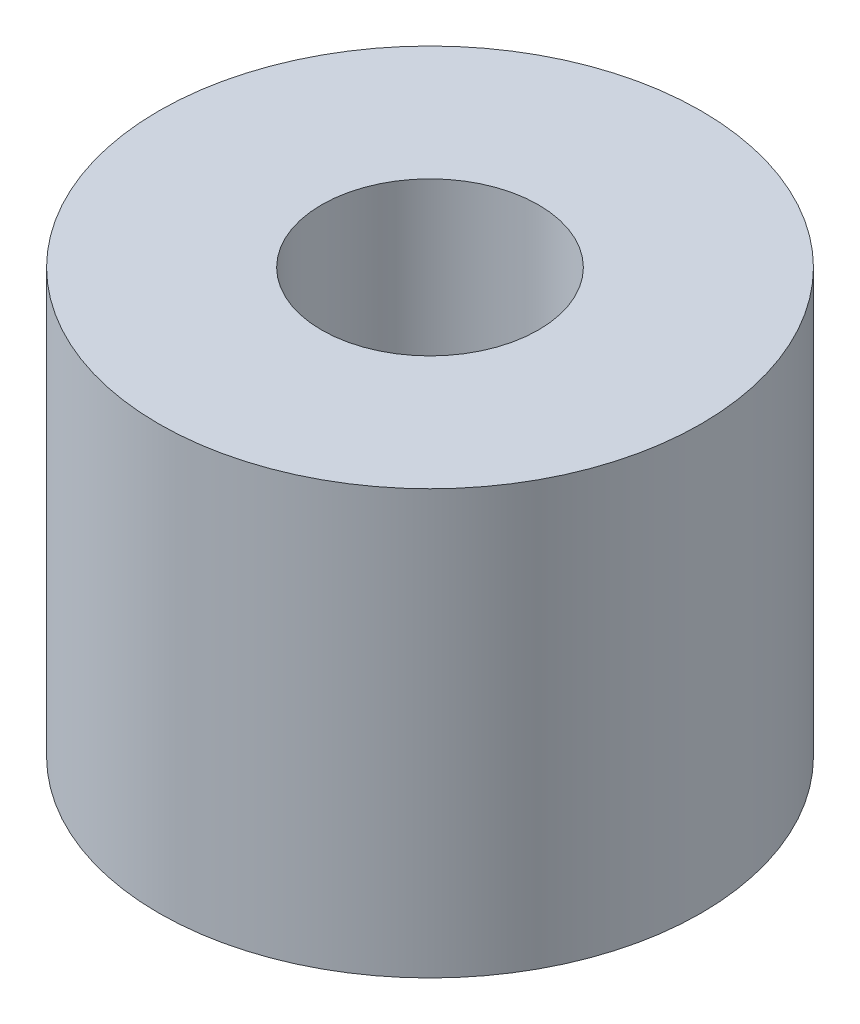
ISO-10303-21;
HEADER;
FILE_DESCRIPTION(('STEP AP214'),'2;1');
FILE_NAME('part.step','',(''),(''),'','','');
FILE_SCHEMA(('AUTOMOTIVE_DESIGN { 1 0 10303 214 1 1 1 1 }'));
ENDSEC;
DATA;
#1=APPLICATION_CONTEXT('core data for automotive mechanical design processes');
#2=APPLICATION_PROTOCOL_DEFINITION('international standard','automotive_design',2000,#1);
#3=PRODUCT_CONTEXT('',#1,'mechanical');
#4=PRODUCT('Part','Part','',(#3));
#5=PRODUCT_RELATED_PRODUCT_CATEGORY('part','',(#4));
#6=PRODUCT_DEFINITION_FORMATION('','',#4);
#7=PRODUCT_DEFINITION_CONTEXT('part definition',#1,'design');
#8=PRODUCT_DEFINITION('design','',#6,#7);
#9=PRODUCT_DEFINITION_SHAPE('','',#8);
#10=(LENGTH_UNIT() NAMED_UNIT(*) SI_UNIT(.MILLI.,.METRE.));
#11=(NAMED_UNIT(*) PLANE_ANGLE_UNIT() SI_UNIT($,.RADIAN.));
#12=(NAMED_UNIT(*) SI_UNIT($,.STERADIAN.) SOLID_ANGLE_UNIT());
#13=UNCERTAINTY_MEASURE_WITH_UNIT(LENGTH_MEASURE(1.E-05),#10,'distance_accuracy_value','');
#14=(GEOMETRIC_REPRESENTATION_CONTEXT(3) GLOBAL_UNCERTAINTY_ASSIGNED_CONTEXT((#13)) GLOBAL_UNIT_ASSIGNED_CONTEXT((#10,
#11,#12)) REPRESENTATION_CONTEXT('',''));
#15=CARTESIAN_POINT('',(0.,0.,0.));
#16=DIRECTION('',(0.,0.,1.));
#17=DIRECTION('',(1.,0.,0.));
#18=AXIS2_PLACEMENT_3D('',#15,#16,#17);
#19=CARTESIAN_POINT('',(0.,6.25,0.));
#20=DIRECTION('',(0.,1.,0.));
#21=DIRECTION('',(0.,0.,1.));
#22=AXIS2_PLACEMENT_3D('',#19,#20,#21);
#23=PLANE('',#22);
#24=CARTESIAN_POINT('',(0.,6.25,0.));
#25=DIRECTION('',(0.,1.,0.));
#26=DIRECTION('',(0.,0.,1.));
#27=AXIS2_PLACEMENT_3D('',#24,#25,#26);
#28=CIRCLE('',#27,4.);
#29=CARTESIAN_POINT('',(0.,6.25,4.));
#30=VERTEX_POINT('',#29);
#31=EDGE_CURVE('E10',#30,#30,#28,.T.);
#32=ORIENTED_EDGE('',*,*,#31,.T.);
#33=EDGE_LOOP('',(#32));
#34=FACE_BOUND('',#33,.T.);
#35=CARTESIAN_POINT('',(0.,6.25,0.));
#36=DIRECTION('',(0.,1.,0.));
#37=DIRECTION('',(0.,0.,1.));
#38=AXIS2_PLACEMENT_3D('',#35,#36,#37);
#39=CIRCLE('',#38,1.6);
#40=CARTESIAN_POINT('',(0.,6.25,1.6));
#41=VERTEX_POINT('',#40);
#42=EDGE_CURVE('E50',#41,#41,#39,.T.);
#43=ORIENTED_EDGE('',*,*,#42,.F.);
#44=EDGE_LOOP('',(#43));
#45=FACE_BOUND('',#44,.T.);
#46=ADVANCED_FACE('F39',(#34,#45),#23,.T.);
#47=CARTESIAN_POINT('',(0.,0.,0.));
#48=DIRECTION('',(0.,1.,0.));
#49=DIRECTION('',(0.,0.,1.));
#50=AXIS2_PLACEMENT_3D('',#47,#48,#49);
#51=PLANE('',#50);
#52=CARTESIAN_POINT('',(0.,0.,0.));
#53=DIRECTION('',(0.,1.,0.));
#54=DIRECTION('',(0.,0.,1.));
#55=AXIS2_PLACEMENT_3D('',#52,#53,#54);
#56=CIRCLE('',#55,4.);
#57=CARTESIAN_POINT('',(0.,0.,4.));
#58=VERTEX_POINT('',#57);
#59=EDGE_CURVE('E43',#58,#58,#56,.T.);
#60=ORIENTED_EDGE('',*,*,#59,.F.);
#61=EDGE_LOOP('',(#60));
#62=FACE_BOUND('',#61,.T.);
#63=CARTESIAN_POINT('',(0.,0.,0.));
#64=DIRECTION('',(0.,1.,0.));
#65=DIRECTION('',(0.,0.,1.));
#66=AXIS2_PLACEMENT_3D('',#63,#64,#65);
#67=CIRCLE('',#66,1.6);
#68=CARTESIAN_POINT('',(0.,0.,1.6));
#69=VERTEX_POINT('',#68);
#70=EDGE_CURVE('E52',#69,#69,#67,.T.);
#71=ORIENTED_EDGE('',*,*,#70,.T.);
#72=EDGE_LOOP('',(#71));
#73=FACE_BOUND('',#72,.T.);
#74=ADVANCED_FACE('F62',(#62,#73),#51,.F.);
#75=CARTESIAN_POINT('',(0.,6.25,0.));
#76=DIRECTION('',(0.,-1.,0.));
#77=DIRECTION('',(0.,0.,-1.));
#78=AXIS2_PLACEMENT_3D('',#75,#76,#77);
#79=CYLINDRICAL_SURFACE('',#78,4.);
#80=ORIENTED_EDGE('',*,*,#31,.F.);
#81=EDGE_LOOP('',(#80));
#82=FACE_BOUND('',#81,.T.);
#83=ORIENTED_EDGE('',*,*,#59,.T.);
#84=EDGE_LOOP('',(#83));
#85=FACE_BOUND('',#84,.T.);
#86=ADVANCED_FACE('F41',(#82,#85),#79,.T.);
#87=CARTESIAN_POINT('',(0.,6.25,0.));
#88=DIRECTION('',(0.,-1.,0.));
#89=DIRECTION('',(0.,0.,-1.));
#90=AXIS2_PLACEMENT_3D('',#87,#88,#89);
#91=CYLINDRICAL_SURFACE('',#90,1.6);
#92=ORIENTED_EDGE('',*,*,#42,.T.);
#93=EDGE_LOOP('',(#92));
#94=FACE_BOUND('',#93,.T.);
#95=ORIENTED_EDGE('',*,*,#70,.F.);
#96=EDGE_LOOP('',(#95));
#97=FACE_BOUND('',#96,.T.);
#98=ADVANCED_FACE('F58',(#94,#97),#91,.F.);
#99=CLOSED_SHELL('',(#46,#74,#86,#98));
#100=MANIFOLD_SOLID_BREP('B2',#99);
#101=ADVANCED_BREP_SHAPE_REPRESENTATION('',(#18,#100),#14);
#102=SHAPE_DEFINITION_REPRESENTATION(#9,#101);
ENDSEC;
END-ISO-10303-21;
